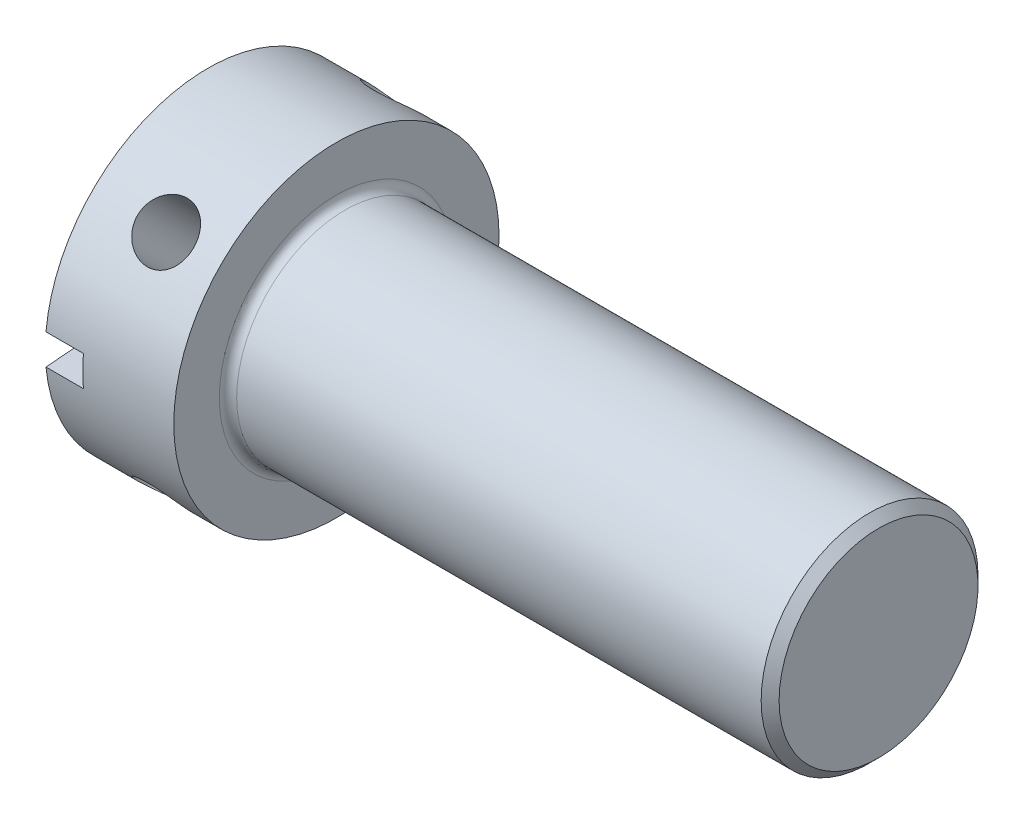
from build123d import *

# Parameters (mm, degrees)
FILLET1_R         = 0.8
SLOT_DEPTH        = 67.001893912
SLOT_DEPTH_BACK   = 67.001893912
HOLESKE_R         = 2.59
DRILL_HOLE_DEPTH  = 67.001893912
DRILL_HOLES_COUNT = 2
DRILL_HOLES_ANGLE = 90


with BuildPart() as part:
    # BodySke → Base-Revolve (revolve)
    with BuildSketch(Plane.XY, mode=Mode.PRIVATE) as base_revolve_sk:
        with BuildLine():
            Line((0.65, 15), (12.5, 15))
            Line((12.5, 15), (12.5, 10))
            Line((12.5, 10), (61.672, 10))
            Line((61.672, 10), (62.5, 9.172))
            Line((62.5, 9.172), (62.5, 0))
            Line((62.5, 0), (0, 0))
            ThreePointArc((0, 0), (0.162576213, 7.507038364), (0.65, 15))
        make_face()
    revolve(base_revolve_sk.sketch.rotate(Axis((-31.75, 0, 0), (1, 0, 0)), 90), axis=Axis((-31.75, 0, 0), (1, 0, 0)))

    # Fillet1
    fillet1_edges = [part.edges().sort_by_distance(p)[0] for p in [
        (12.5, 0, -10),
    ]]
    fillet(fillet1_edges, radius=FILLET1_R)

    # Sketch3 → Slot (cut, two sides: drawn at the far end of the back side and taken through both)
    with BuildSketch(Plane.XY.offset(-SLOT_DEPTH_BACK)):
        Polygon((-139.217564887, 1.405), (0.005692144, 1.405), (4.105692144, 1.405), (4.105692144, -1.405), (0.005692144, -1.405), (-139.217564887, -1.405), (-417.664078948, -1.405), (-417.664078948, 1.405), align=None)
    extrude(amount=SLOT_DEPTH + SLOT_DEPTH_BACK, mode=Mode.SUBTRACT)

    # HoleSke → Drill Hole (cut, symmetric)
    with BuildSketch(Plane(origin=(0, 0, 0), x_dir=(1, 0, 0), z_dir=(0, 0.7071067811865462, 0.7071067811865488))):
        with Locations(Location((7.35, 0, 0), (0, 0, 270))):
            Circle(HOLESKE_R)
    drill_hole = extrude(amount=DRILL_HOLE_DEPTH, both=True, mode=Mode.SUBTRACT)

    # Drill Holes: Drill Hole ×2 about axis
    drill_holes_axis = Axis((0, 0, 0), (1, 0, 0))
    for i in range(1, DRILL_HOLES_COUNT):
        add(drill_hole.rotate(drill_holes_axis, i * DRILL_HOLES_ANGLE / (DRILL_HOLES_COUNT - 1)), mode=Mode.SUBTRACT)


solid = part.part
